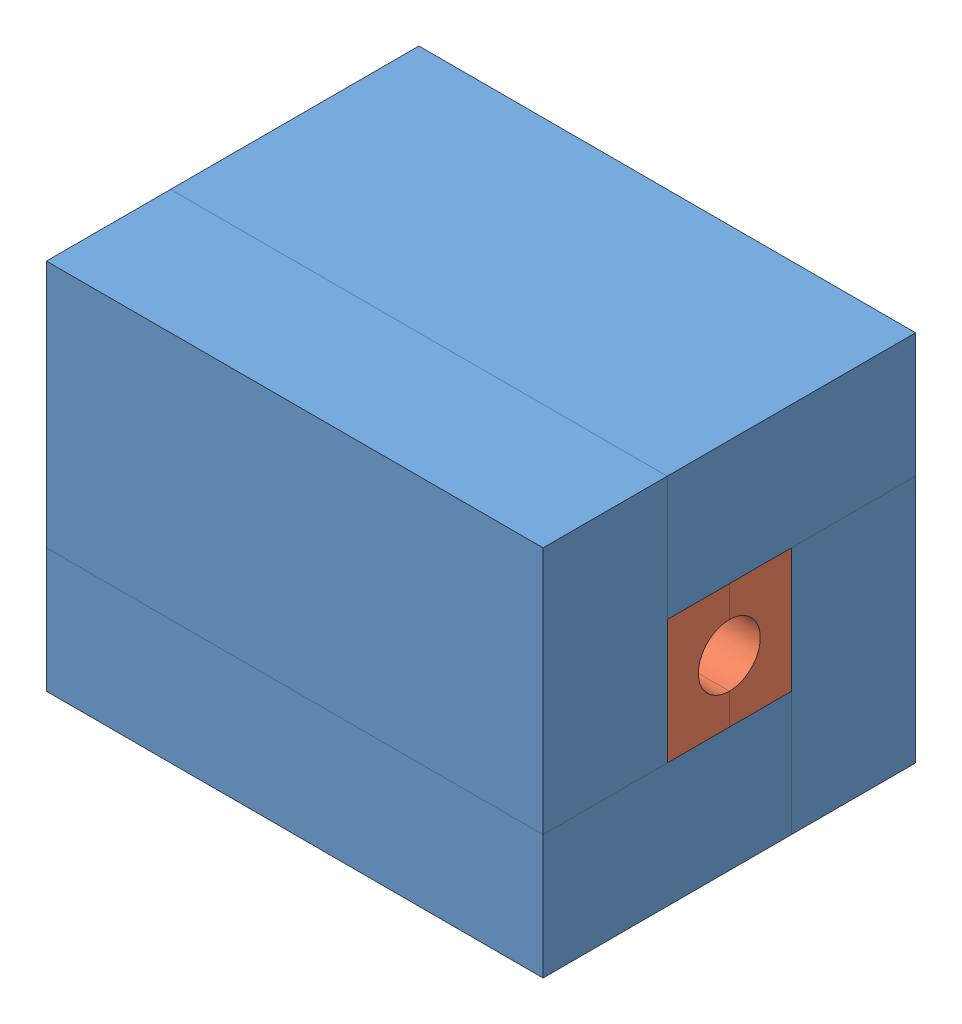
SolidWorks assembly LeadHouse.SLDASM, configuration Default (file format 8000). Lengths in mm.
Overall size (203.2 152.4 152.4).
10 component instances, 3 part files, 25 mates.
Components (placement in the parent):
- BigLeadBlock-1: BigLeadBlock.SLDPRT [Default] at (-56.0462 81.3331 120.6896) size (203.2 50.8 101.6)
- BigLeadBlock-5: BigLeadBlock.SLDPRT [Default] at (-56.0462 182.9331 69.8896) x (1 0 0) z (0 -1 0) size (203.2 50.8 101.6)
- LeadHouseInternalBlock-1: LeadHouseInternalBlock.SLDPRT [Default] at (45.5538 132.1331 146.0896) x (1 0 0) z (0 1 0) size (101.6 25.4 50.8)
- LeadHouseInternalBlock-2: LeadHouseInternalBlock.SLDPRT [Default] at (45.5538 182.9331 146.0896) x (-1 0 0) z (0 -1 0) size (101.6 25.4 50.8)
- LeadHouseInternalBlock-5: LeadHouseInternalBlock.SLDPRT [Default] at (45.5538 182.9331 146.0896) x (1 0 0) z (0 -1 0) size (101.6 25.4 50.8)
- LeadHouseInternalBlock-4: LeadHouseInternalBlock.SLDPRT [Default] at (45.5538 132.1331 146.0896) x (-1 0 0) z (0 1 0) size (101.6 25.4 50.8)
- BigLeadBlock-3: BigLeadBlock.SLDPRT [Default] at (-56.0462 233.7331 171.4896) x (1 0 0) z (0 -1 0) size (203.2 50.8 101.6)
- BigLeadBlock-4: BigLeadBlock.SLDPRT [Default] at (-56.0462 182.9331 69.8896) size (203.2 50.8 101.6)
- Source-2: Source.SLDPRT [Default] at (49.3638 157.5331 146.0896) x (0 1 0) z (0 0 1) size (25.4 3.81 25.4)
- Source-3: Source.SLDPRT [Default] at (41.7438 157.5331 146.0896) x (0 -1 0) z (0 0 1) size (25.4 3.81 25.4)
Mates (geometry in assembly coordinates):
- Coincident1: coincident anti-aligned: plane of BigLeadBlock-1 through (-56.0462 132.1331 120.6896) normal (0 0 -1); plane of BigLeadBlock-5 through (-56.0462 182.9331 120.6896) normal (0 0 1)
- Coincident2: coincident aligned: plane of BigLeadBlock-1 through (-56.0462 81.3331 120.6896) normal (0 -1 0); plane of BigLeadBlock-5 through (-56.0462 81.3331 120.6896) normal (0 -1 0)
- Coincident3: coincident aligned: plane of BigLeadBlock-1 through (147.1538 132.1331 120.6896) normal (1 0 0); plane of BigLeadBlock-5 through (147.1538 182.9331 120.6896) normal (1 0 0)
- Coincident4: coincident anti-aligned: plane of BigLeadBlock-5 through (-56.0462 182.9331 120.6896) normal (0 0 1); plane of LeadHouseInternalBlock-1 through (45.5538 132.1331 120.6896) normal (0 0 -1)
- Coincident5: coincident aligned: plane of BigLeadBlock-5 through (147.1538 182.9331 120.6896) normal (1 0 0); plane of LeadHouseInternalBlock-1 through (147.1538 132.1331 120.6896) normal (1 0 0)
- Coincident6: coincident anti-aligned: plane of BigLeadBlock-1 through (-56.0462 132.1331 120.6896) normal (0 1 0); plane of LeadHouseInternalBlock-1 through (45.5538 132.1331 120.6896) normal (0 -1 0)
- Coincident7: coincident anti-aligned: plane of LeadHouseInternalBlock-1 through (45.5538 132.1331 120.6896) normal (-1 0 0); plane of LeadHouseInternalBlock-2 through (45.5538 182.9331 120.6896) normal (1 0 0)
- Coincident8: coincident anti-aligned: plane of BigLeadBlock-5 through (-56.0462 182.9331 120.6896) normal (0 0 1); plane of LeadHouseInternalBlock-2 through (45.5538 182.9331 120.6896) normal (0 0 -1)
- Coincident9: coincident anti-aligned: plane of BigLeadBlock-1 through (-56.0462 132.1331 120.6896) normal (0 1 0); plane of LeadHouseInternalBlock-2 through (45.5538 132.1331 120.6896) normal (0 -1 0)
- Coincident10: coincident anti-aligned: plane of BigLeadBlock-1 through (-56.0462 132.1331 120.6896) normal (0 1 0); plane of LeadHouseInternalBlock-5 through (45.5538 132.1331 171.4896) normal (0 -1 0)
- Coincident11: coincident aligned: plane of LeadHouseInternalBlock-1 through (147.1538 132.1331 120.6896) normal (1 0 0); plane of LeadHouseInternalBlock-5 through (147.1538 182.9331 171.4896) normal (1 0 0)
- Coincident12: coincident anti-aligned: plane of LeadHouseInternalBlock-1 through (45.5538 132.1331 146.0896) normal (0 0 1); plane of LeadHouseInternalBlock-5 through (45.5538 182.9331 146.0896) normal (0 0 -1)
- Coincident13: coincident anti-aligned: plane of LeadHouseInternalBlock-5 through (45.5538 182.9331 171.4896) normal (-1 0 0); plane of LeadHouseInternalBlock-4 through (45.5538 132.1331 171.4896) normal (1 0 0)
- Coincident14: coincident anti-aligned: plane of BigLeadBlock-1 through (-56.0462 132.1331 120.6896) normal (0 1 0); plane of LeadHouseInternalBlock-4 through (45.5538 132.1331 171.4896) normal (0 -1 0)
- Coincident15: coincident anti-aligned: plane of LeadHouseInternalBlock-2 through (45.5538 182.9331 146.0896) normal (0 0 1); plane of LeadHouseInternalBlock-4 through (45.5538 132.1331 146.0896) normal (0 0 -1)
- Coincident16: coincident anti-aligned: plane of BigLeadBlock-1 through (-56.0462 132.1331 120.6896) normal (0 1 0); plane of BigLeadBlock-3 through (-56.0462 132.1331 222.2896) normal (0 -1 0)
- Coincident17: coincident anti-aligned: plane of LeadHouseInternalBlock-4 through (45.5538 132.1331 171.4896) normal (0 0 1); plane of BigLeadBlock-3 through (-56.0462 233.7331 171.4896) normal (0 0 -1)
- Coincident18: coincident aligned: plane of BigLeadBlock-1 through (-56.0462 132.1331 120.6896) normal (-1 0 0); plane of BigLeadBlock-3 through (-56.0462 233.7331 222.2896) normal (-1 0 0)
- Coincident19: coincident aligned: plane of BigLeadBlock-5 through (-56.0462 182.9331 120.6896) normal (-1 0 0); plane of BigLeadBlock-4 through (-56.0462 233.7331 69.8896) normal (-1 0 0)
- Coincident20: coincident anti-aligned: plane of BigLeadBlock-3 through (-56.0462 233.7331 171.4896) normal (0 0 -1); plane of BigLeadBlock-4 through (-56.0462 233.7331 171.4896) normal (0 0 1)
- Coincident21: coincident anti-aligned: plane of BigLeadBlock-5 through (-56.0462 182.9331 120.6896) normal (0 1 0); plane of BigLeadBlock-4 through (-56.0462 182.9331 69.8896) normal (0 -1 0)
- Concentric1: concentric aligned: circle of LeadHouseInternalBlock-1; circle of Source-2
- Coincident23: coincident aligned: circle of LeadHouseInternalBlock-1; circle of Source-2
- Coincident24: coincident anti-aligned: circle of Source-2; plane of Source-3 through (45.5538 157.5331 146.0896) normal (1 0 0)
- Coincident25: coincident aligned: circle of LeadHouseInternalBlock-2; circle of Source-3
